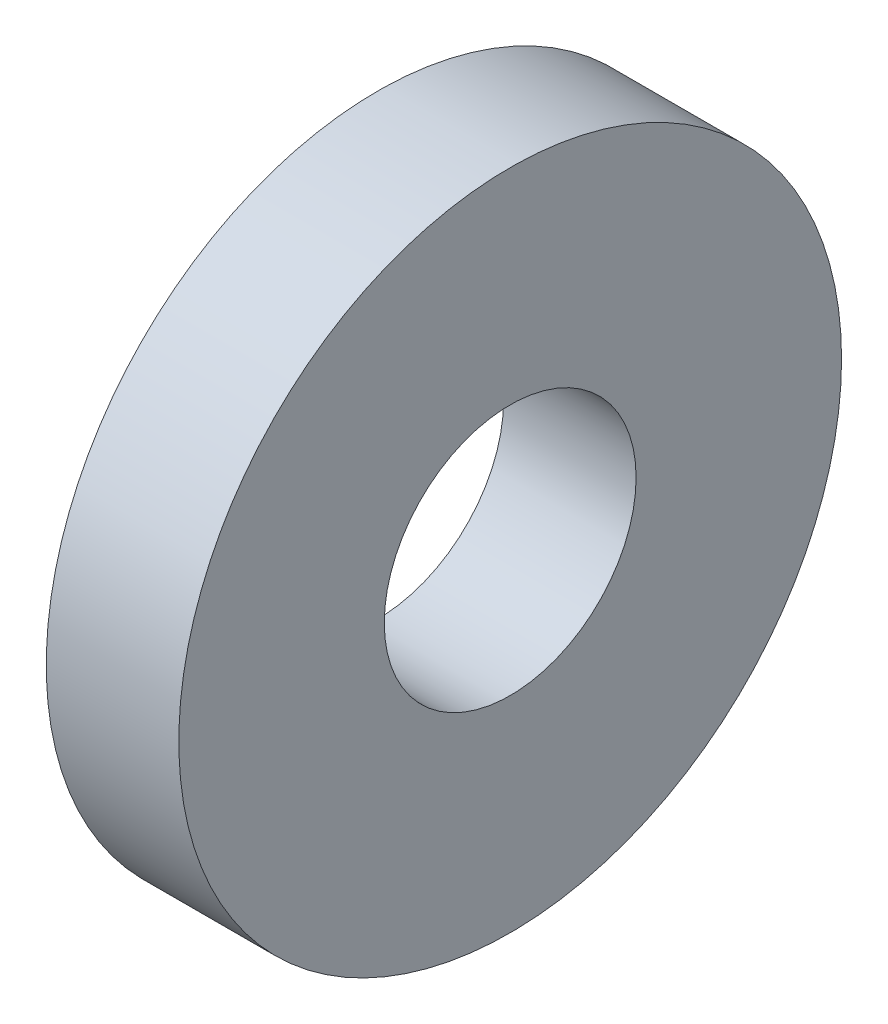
from build123d import *

# Parameters (mm, degrees)
SKETCH1_R          = 2.5
SKETCH1_R_2        = 0.95
BASE_EXTRUDE_DEPTH = 1


with BuildPart() as part:
    # Sketch1 → Base-Extrude (new body)
    with BuildSketch(Plane(origin=(0, 0, 0), x_dir=(0, 0, -1), z_dir=(1, 0, 0))):
        Circle(SKETCH1_R)
        Circle(SKETCH1_R_2, mode=Mode.SUBTRACT)
    extrude(amount=BASE_EXTRUDE_DEPTH)


solid = part.part
